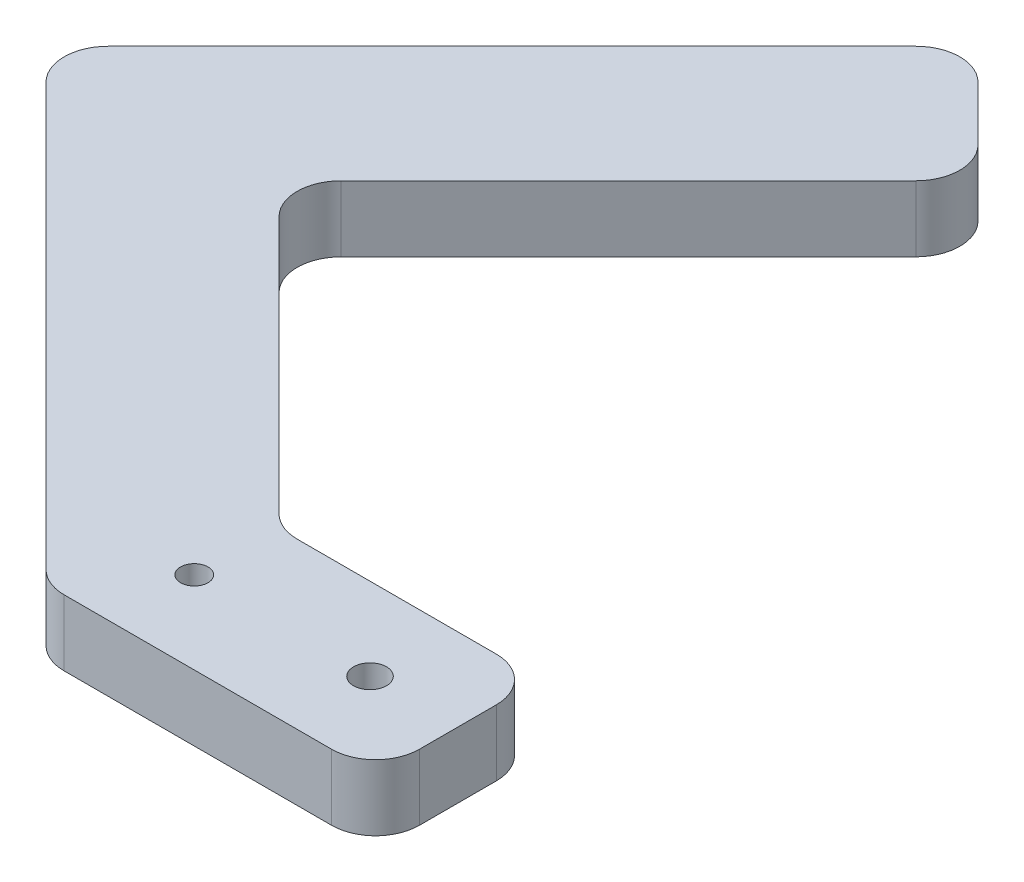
ISO-10303-21;
HEADER;
FILE_DESCRIPTION(('STEP AP214'),'2;1');
FILE_NAME('part.step','',(''),(''),'','','');
FILE_SCHEMA(('AUTOMOTIVE_DESIGN { 1 0 10303 214 1 1 1 1 }'));
ENDSEC;
DATA;
#1=APPLICATION_CONTEXT('core data for automotive mechanical design processes');
#2=APPLICATION_PROTOCOL_DEFINITION('international standard','automotive_design',2000,#1);
#3=PRODUCT_CONTEXT('',#1,'mechanical');
#4=PRODUCT('Part','Part','',(#3));
#5=PRODUCT_RELATED_PRODUCT_CATEGORY('part','',(#4));
#6=PRODUCT_DEFINITION_FORMATION('','',#4);
#7=PRODUCT_DEFINITION_CONTEXT('part definition',#1,'design');
#8=PRODUCT_DEFINITION('design','',#6,#7);
#9=PRODUCT_DEFINITION_SHAPE('','',#8);
#10=(LENGTH_UNIT() NAMED_UNIT(*) SI_UNIT(.MILLI.,.METRE.));
#11=(NAMED_UNIT(*) PLANE_ANGLE_UNIT() SI_UNIT($,.RADIAN.));
#12=(NAMED_UNIT(*) SI_UNIT($,.STERADIAN.) SOLID_ANGLE_UNIT());
#13=UNCERTAINTY_MEASURE_WITH_UNIT(LENGTH_MEASURE(1.E-05),#10,'distance_accuracy_value','');
#14=(GEOMETRIC_REPRESENTATION_CONTEXT(3) GLOBAL_UNCERTAINTY_ASSIGNED_CONTEXT((#13)) GLOBAL_UNIT_ASSIGNED_CONTEXT((#10,
#11,#12)) REPRESENTATION_CONTEXT('',''));
#15=CARTESIAN_POINT('',(0.,0.,0.));
#16=DIRECTION('',(0.,0.,1.));
#17=DIRECTION('',(1.,0.,0.));
#18=AXIS2_PLACEMENT_3D('',#15,#16,#17);
#19=CARTESIAN_POINT('',(0.,6.,0.));
#20=DIRECTION('',(0.,1.,0.));
#21=DIRECTION('',(0.,0.,1.));
#22=AXIS2_PLACEMENT_3D('',#19,#20,#21);
#23=PLANE('',#22);
#24=CARTESIAN_POINT('',(-8.,6.,-7.5));
#25=DIRECTION('',(0.,1.,0.));
#26=DIRECTION('',(0.,0.,1.));
#27=AXIS2_PLACEMENT_3D('',#24,#25,#26);
#28=CIRCLE('',#27,1.5);
#29=CARTESIAN_POINT('',(-8.,6.,-6.));
#30=VERTEX_POINT('',#29);
#31=EDGE_CURVE('E338',#30,#30,#28,.T.);
#32=ORIENTED_EDGE('',*,*,#31,.F.);
#33=EDGE_LOOP('',(#32));
#34=FACE_BOUND('',#33,.T.);
#35=DIRECTION('',(0.,0.,-1.));
#36=VECTOR('',#35,1.);
#37=CARTESIAN_POINT('',(0.,6.,0.));
#38=LINE('',#37,#36);
#39=CARTESIAN_POINT('',(0.,6.,-4.));
#40=VERTEX_POINT('',#39);
#41=CARTESIAN_POINT('',(0.,6.,-11.));
#42=VERTEX_POINT('',#41);
#43=EDGE_CURVE('E322',#40,#42,#38,.T.);
#44=ORIENTED_EDGE('',*,*,#43,.T.);
#45=CARTESIAN_POINT('',(-4.,6.,-11.));
#46=DIRECTION('',(0.,1.,0.));
#47=DIRECTION('',(0.,0.,1.));
#48=AXIS2_PLACEMENT_3D('',#45,#46,#47);
#49=CIRCLE('',#48,4.);
#50=CARTESIAN_POINT('',(-4.,6.,-15.));
#51=VERTEX_POINT('',#50);
#52=EDGE_CURVE('E264',#42,#51,#49,.T.);
#53=ORIENTED_EDGE('',*,*,#52,.T.);
#54=DIRECTION('',(-1.,0.,0.));
#55=VECTOR('',#54,1.);
#56=CARTESIAN_POINT('',(0.,6.,-15.));
#57=LINE('',#56,#55);
#58=CARTESIAN_POINT('',(-22.1299423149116,6.,-15.));
#59=VERTEX_POINT('',#58);
#60=EDGE_CURVE('E313',#51,#59,#57,.T.);
#61=ORIENTED_EDGE('',*,*,#60,.T.);
#62=CARTESIAN_POINT('',(-22.1299423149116,6.,-19.));
#63=DIRECTION('',(0.,1.,0.));
#64=DIRECTION('',(0.,0.,1.));
#65=AXIS2_PLACEMENT_3D('',#62,#63,#64);
#66=CIRCLE('',#65,4.);
#67=CARTESIAN_POINT('',(-24.9583694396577,6.,-16.1715728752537));
#68=VERTEX_POINT('',#67);
#69=EDGE_CURVE('E11',#59,#68,#66,.F.);
#70=ORIENTED_EDGE('',*,*,#69,.T.);
#71=DIRECTION('',(-0.707106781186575,0.,-0.707106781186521));
#72=VECTOR('',#71,1.);
#73=CARTESIAN_POINT('',(-23.7867965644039,6.,-15.));
#74=LINE('',#73,#72);
#75=CARTESIAN_POINT('',(-48.3847763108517,6.,-39.5979797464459));
#76=VERTEX_POINT('',#75);
#77=EDGE_CURVE('E312',#68,#76,#74,.T.);
#78=ORIENTED_EDGE('',*,*,#77,.T.);
#79=CARTESIAN_POINT('',(-45.5563491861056,6.,-42.4264068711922));
#80=DIRECTION('',(0.,1.,0.));
#81=DIRECTION('',(0.,0.,1.));
#82=AXIS2_PLACEMENT_3D('',#79,#80,#81);
#83=CIRCLE('',#82,4.);
#84=CARTESIAN_POINT('',(-48.3847763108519,6.,-45.2548339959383));
#85=VERTEX_POINT('',#84);
#86=EDGE_CURVE('E171',#76,#85,#83,.F.);
#87=ORIENTED_EDGE('',*,*,#86,.T.);
#88=DIRECTION('',(0.707106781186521,0.,-0.707106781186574));
#89=VECTOR('',#88,1.);
#90=CARTESIAN_POINT('',(-51.213203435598,6.,-42.426406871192));
#91=LINE('',#90,#89);
#92=CARTESIAN_POINT('',(-22.2218254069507,6.,-71.4177848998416));
#93=VERTEX_POINT('',#92);
#94=EDGE_CURVE('E181',#85,#93,#91,.T.);
#95=ORIENTED_EDGE('',*,*,#94,.T.);
#96=CARTESIAN_POINT('',(-25.050252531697,6.,-74.2462120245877));
#97=DIRECTION('',(0.,1.,0.));
#98=DIRECTION('',(0.,0.,1.));
#99=AXIS2_PLACEMENT_3D('',#96,#97,#98);
#100=CIRCLE('',#99,4.);
#101=CARTESIAN_POINT('',(-22.2218254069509,6.,-77.074639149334));
#102=VERTEX_POINT('',#101);
#103=EDGE_CURVE('E253',#93,#102,#100,.T.);
#104=ORIENTED_EDGE('',*,*,#103,.T.);
#105=DIRECTION('',(-0.707106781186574,0.,-0.707106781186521));
#106=VECTOR('',#105,1.);
#107=CARTESIAN_POINT('',(-19.3933982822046,6.,-74.2462120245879));
#108=LINE('',#107,#106);
#109=CARTESIAN_POINT('',(-27.1715728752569,6.,-82.0243866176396));
#110=VERTEX_POINT('',#109);
#111=EDGE_CURVE('E320',#102,#110,#108,.T.);
#112=ORIENTED_EDGE('',*,*,#111,.T.);
#113=CARTESIAN_POINT('',(-30.000000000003,6.,-79.1959594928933));
#114=DIRECTION('',(0.,1.,0.));
#115=DIRECTION('',(0.,0.,1.));
#116=AXIS2_PLACEMENT_3D('',#113,#114,#115);
#117=CIRCLE('',#116,4.);
#118=CARTESIAN_POINT('',(-32.8284271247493,6.,-82.0243866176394));
#119=VERTEX_POINT('',#118);
#120=EDGE_CURVE('E250',#110,#119,#117,.T.);
#121=ORIENTED_EDGE('',*,*,#120,.T.);
#122=DIRECTION('',(-0.707106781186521,0.,0.707106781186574));
#123=VECTOR('',#122,1.);
#124=CARTESIAN_POINT('',(-30.0000000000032,6.,-84.8528137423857));
#125=LINE('',#124,#123);
#126=CARTESIAN_POINT('',(-69.5979797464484,6.,-45.2548339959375));
#127=VERTEX_POINT('',#126);
#128=EDGE_CURVE('E329',#119,#127,#125,.T.);
#129=ORIENTED_EDGE('',*,*,#128,.T.);
#130=CARTESIAN_POINT('',(-66.7695526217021,6.,-42.4264068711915));
#131=DIRECTION('',(0.,1.,0.));
#132=DIRECTION('',(0.,0.,1.));
#133=AXIS2_PLACEMENT_3D('',#130,#131,#132);
#134=CIRCLE('',#133,4.);
#135=CARTESIAN_POINT('',(-69.5979797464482,6.,-39.5979797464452));
#136=VERTEX_POINT('',#135);
#137=EDGE_CURVE('E68',#127,#136,#134,.T.);
#138=ORIENTED_EDGE('',*,*,#137,.T.);
#139=DIRECTION('',(0.707106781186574,0.,0.707106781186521));
#140=VECTOR('',#139,1.);
#141=CARTESIAN_POINT('',(-72.4264068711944,6.,-42.4264068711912));
#142=LINE('',#141,#140);
#143=CARTESIAN_POINT('',(-31.1715728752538,6.,-1.17157287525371));
#144=VERTEX_POINT('',#143);
#145=EDGE_CURVE('E212',#136,#144,#142,.T.);
#146=ORIENTED_EDGE('',*,*,#145,.T.);
#147=CARTESIAN_POINT('',(-28.3431457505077,6.,-4.));
#148=DIRECTION('',(0.,1.,0.));
#149=DIRECTION('',(0.,0.,1.));
#150=AXIS2_PLACEMENT_3D('',#147,#148,#149);
#151=CIRCLE('',#150,4.);
#152=CARTESIAN_POINT('',(-28.3431457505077,6.,0.));
#153=VERTEX_POINT('',#152);
#154=EDGE_CURVE('E258',#144,#153,#151,.T.);
#155=ORIENTED_EDGE('',*,*,#154,.T.);
#156=DIRECTION('',(1.,0.,0.));
#157=VECTOR('',#156,1.);
#158=CARTESIAN_POINT('',(-30.,6.,0.));
#159=LINE('',#158,#157);
#160=CARTESIAN_POINT('',(-4.,6.,0.));
#161=VERTEX_POINT('',#160);
#162=EDGE_CURVE('E210',#153,#161,#159,.T.);
#163=ORIENTED_EDGE('',*,*,#162,.T.);
#164=CARTESIAN_POINT('',(-4.,6.,-4.));
#165=DIRECTION('',(0.,1.,0.));
#166=DIRECTION('',(0.,0.,1.));
#167=AXIS2_PLACEMENT_3D('',#164,#165,#166);
#168=CIRCLE('',#167,4.);
#169=EDGE_CURVE('E261',#161,#40,#168,.T.);
#170=ORIENTED_EDGE('',*,*,#169,.T.);
#171=EDGE_LOOP('',(#44,#53,#61,#70,#78,#87,#95,#104,#112,#121,#129,#138,#146,#155,#163,#170));
#172=FACE_BOUND('',#171,.T.);
#173=CARTESIAN_POINT('',(-24.,6.,-7.5));
#174=DIRECTION('',(0.,1.,0.));
#175=DIRECTION('',(0.,0.,1.));
#176=AXIS2_PLACEMENT_3D('',#173,#174,#175);
#177=CIRCLE('',#176,1.25);
#178=CARTESIAN_POINT('',(-24.,6.,-6.25));
#179=VERTEX_POINT('',#178);
#180=EDGE_CURVE('E360',#179,#179,#177,.T.);
#181=ORIENTED_EDGE('',*,*,#180,.F.);
#182=EDGE_LOOP('',(#181));
#183=FACE_BOUND('',#182,.T.);
#184=ADVANCED_FACE('F45',(#34,#172,#183),#23,.T.);
#185=CARTESIAN_POINT('',(0.,0.,0.));
#186=DIRECTION('',(0.,1.,0.));
#187=DIRECTION('',(0.,0.,1.));
#188=AXIS2_PLACEMENT_3D('',#185,#186,#187);
#189=PLANE('',#188);
#190=DIRECTION('',(-1.,0.,0.));
#191=VECTOR('',#190,1.);
#192=CARTESIAN_POINT('',(0.,0.,-15.));
#193=LINE('',#192,#191);
#194=CARTESIAN_POINT('',(-4.,0.,-15.));
#195=VERTEX_POINT('',#194);
#196=CARTESIAN_POINT('',(-22.1299423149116,0.,-15.));
#197=VERTEX_POINT('',#196);
#198=EDGE_CURVE('E200',#195,#197,#193,.T.);
#199=ORIENTED_EDGE('',*,*,#198,.F.);
#200=CARTESIAN_POINT('',(-4.,0.,-11.));
#201=DIRECTION('',(0.,1.,0.));
#202=DIRECTION('',(0.,0.,1.));
#203=AXIS2_PLACEMENT_3D('',#200,#201,#202);
#204=CIRCLE('',#203,4.);
#205=CARTESIAN_POINT('',(0.,0.,-11.));
#206=VERTEX_POINT('',#205);
#207=EDGE_CURVE('E240',#195,#206,#204,.F.);
#208=ORIENTED_EDGE('',*,*,#207,.T.);
#209=DIRECTION('',(0.,0.,-1.));
#210=VECTOR('',#209,1.);
#211=CARTESIAN_POINT('',(0.,0.,0.));
#212=LINE('',#211,#210);
#213=CARTESIAN_POINT('',(0.,0.,-4.));
#214=VERTEX_POINT('',#213);
#215=EDGE_CURVE('E305',#214,#206,#212,.T.);
#216=ORIENTED_EDGE('',*,*,#215,.F.);
#217=CARTESIAN_POINT('',(-4.,0.,-4.));
#218=DIRECTION('',(0.,1.,0.));
#219=DIRECTION('',(0.,0.,1.));
#220=AXIS2_PLACEMENT_3D('',#217,#218,#219);
#221=CIRCLE('',#220,4.);
#222=CARTESIAN_POINT('',(-4.,0.,0.));
#223=VERTEX_POINT('',#222);
#224=EDGE_CURVE('E237',#214,#223,#221,.F.);
#225=ORIENTED_EDGE('',*,*,#224,.T.);
#226=DIRECTION('',(1.,0.,0.));
#227=VECTOR('',#226,1.);
#228=CARTESIAN_POINT('',(-30.,0.,0.));
#229=LINE('',#228,#227);
#230=CARTESIAN_POINT('',(-28.3431457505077,0.,0.));
#231=VERTEX_POINT('',#230);
#232=EDGE_CURVE('E334',#231,#223,#229,.T.);
#233=ORIENTED_EDGE('',*,*,#232,.F.);
#234=CARTESIAN_POINT('',(-28.3431457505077,0.,-4.));
#235=DIRECTION('',(0.,1.,0.));
#236=DIRECTION('',(0.,0.,1.));
#237=AXIS2_PLACEMENT_3D('',#234,#235,#236);
#238=CIRCLE('',#237,4.);
#239=CARTESIAN_POINT('',(-31.1715728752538,0.,-1.17157287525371));
#240=VERTEX_POINT('',#239);
#241=EDGE_CURVE('E234',#231,#240,#238,.F.);
#242=ORIENTED_EDGE('',*,*,#241,.T.);
#243=DIRECTION('',(0.707106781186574,0.,0.707106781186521));
#244=VECTOR('',#243,1.);
#245=CARTESIAN_POINT('',(-72.4264068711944,0.,-42.4264068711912));
#246=LINE('',#245,#244);
#247=CARTESIAN_POINT('',(-69.5979797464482,0.,-39.5979797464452));
#248=VERTEX_POINT('',#247);
#249=EDGE_CURVE('E207',#248,#240,#246,.T.);
#250=ORIENTED_EDGE('',*,*,#249,.F.);
#251=CARTESIAN_POINT('',(-66.7695526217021,0.,-42.4264068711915));
#252=DIRECTION('',(0.,1.,0.));
#253=DIRECTION('',(0.,0.,1.));
#254=AXIS2_PLACEMENT_3D('',#251,#252,#253);
#255=CIRCLE('',#254,4.);
#256=CARTESIAN_POINT('',(-69.5979797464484,0.,-45.2548339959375));
#257=VERTEX_POINT('',#256);
#258=EDGE_CURVE('E231',#248,#257,#255,.F.);
#259=ORIENTED_EDGE('',*,*,#258,.T.);
#260=DIRECTION('',(-0.707106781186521,0.,0.707106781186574));
#261=VECTOR('',#260,1.);
#262=CARTESIAN_POINT('',(-30.0000000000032,0.,-84.8528137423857));
#263=LINE('',#262,#261);
#264=CARTESIAN_POINT('',(-32.8284271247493,0.,-82.0243866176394));
#265=VERTEX_POINT('',#264);
#266=EDGE_CURVE('E198',#265,#257,#263,.T.);
#267=ORIENTED_EDGE('',*,*,#266,.F.);
#268=CARTESIAN_POINT('',(-30.000000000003,0.,-79.1959594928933));
#269=DIRECTION('',(0.,1.,0.));
#270=DIRECTION('',(0.,0.,1.));
#271=AXIS2_PLACEMENT_3D('',#268,#269,#270);
#272=CIRCLE('',#271,4.);
#273=CARTESIAN_POINT('',(-27.1715728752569,0.,-82.0243866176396));
#274=VERTEX_POINT('',#273);
#275=EDGE_CURVE('E226',#265,#274,#272,.F.);
#276=ORIENTED_EDGE('',*,*,#275,.T.);
#277=DIRECTION('',(-0.707106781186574,0.,-0.707106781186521));
#278=VECTOR('',#277,1.);
#279=CARTESIAN_POINT('',(-19.3933982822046,0.,-74.2462120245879));
#280=LINE('',#279,#278);
#281=CARTESIAN_POINT('',(-22.2218254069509,0.,-77.074639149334));
#282=VERTEX_POINT('',#281);
#283=EDGE_CURVE('E192',#282,#274,#280,.T.);
#284=ORIENTED_EDGE('',*,*,#283,.F.);
#285=CARTESIAN_POINT('',(-25.050252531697,0.,-74.2462120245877));
#286=DIRECTION('',(0.,1.,0.));
#287=DIRECTION('',(0.,0.,1.));
#288=AXIS2_PLACEMENT_3D('',#285,#286,#287);
#289=CIRCLE('',#288,4.);
#290=CARTESIAN_POINT('',(-22.2218254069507,0.,-71.4177848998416));
#291=VERTEX_POINT('',#290);
#292=EDGE_CURVE('E190',#282,#291,#289,.F.);
#293=ORIENTED_EDGE('',*,*,#292,.T.);
#294=DIRECTION('',(0.707106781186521,0.,-0.707106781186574));
#295=VECTOR('',#294,1.);
#296=CARTESIAN_POINT('',(-51.213203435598,0.,-42.426406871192));
#297=LINE('',#296,#295);
#298=CARTESIAN_POINT('',(-48.3847763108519,0.,-45.2548339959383));
#299=VERTEX_POINT('',#298);
#300=EDGE_CURVE('E178',#299,#291,#297,.T.);
#301=ORIENTED_EDGE('',*,*,#300,.F.);
#302=CARTESIAN_POINT('',(-45.5563491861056,0.,-42.4264068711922));
#303=DIRECTION('',(0.,1.,0.));
#304=DIRECTION('',(0.,0.,1.));
#305=AXIS2_PLACEMENT_3D('',#302,#303,#304);
#306=CIRCLE('',#305,4.);
#307=CARTESIAN_POINT('',(-48.3847763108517,0.,-39.5979797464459));
#308=VERTEX_POINT('',#307);
#309=EDGE_CURVE('E160',#299,#308,#306,.T.);
#310=ORIENTED_EDGE('',*,*,#309,.T.);
#311=DIRECTION('',(-0.707106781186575,0.,-0.707106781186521));
#312=VECTOR('',#311,1.);
#313=CARTESIAN_POINT('',(-23.7867965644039,0.,-15.));
#314=LINE('',#313,#312);
#315=CARTESIAN_POINT('',(-24.9583694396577,0.,-16.1715728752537));
#316=VERTEX_POINT('',#315);
#317=EDGE_CURVE('E193',#316,#308,#314,.T.);
#318=ORIENTED_EDGE('',*,*,#317,.F.);
#319=CARTESIAN_POINT('',(-22.1299423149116,0.,-19.));
#320=DIRECTION('',(0.,1.,0.));
#321=DIRECTION('',(0.,0.,1.));
#322=AXIS2_PLACEMENT_3D('',#319,#320,#321);
#323=CIRCLE('',#322,4.);
#324=EDGE_CURVE('E54',#316,#197,#323,.T.);
#325=ORIENTED_EDGE('',*,*,#324,.T.);
#326=EDGE_LOOP('',(#199,#208,#216,#225,#233,#242,#250,#259,#267,#276,#284,#293,#301,#310,#318,#325));
#327=FACE_BOUND('',#326,.T.);
#328=CARTESIAN_POINT('',(-8.,0.,-7.5));
#329=DIRECTION('',(0.,1.,0.));
#330=DIRECTION('',(0.,0.,1.));
#331=AXIS2_PLACEMENT_3D('',#328,#329,#330);
#332=CIRCLE('',#331,1.5);
#333=CARTESIAN_POINT('',(-8.,0.,-6.));
#334=VERTEX_POINT('',#333);
#335=EDGE_CURVE('E356',#334,#334,#332,.T.);
#336=ORIENTED_EDGE('',*,*,#335,.T.);
#337=EDGE_LOOP('',(#336));
#338=FACE_BOUND('',#337,.T.);
#339=CARTESIAN_POINT('',(-24.,0.,-7.5));
#340=DIRECTION('',(0.,1.,0.));
#341=DIRECTION('',(0.,0.,1.));
#342=AXIS2_PLACEMENT_3D('',#339,#340,#341);
#343=CIRCLE('',#342,1.25);
#344=CARTESIAN_POINT('',(-24.,0.,-6.25));
#345=VERTEX_POINT('',#344);
#346=EDGE_CURVE('E364',#345,#345,#343,.T.);
#347=ORIENTED_EDGE('',*,*,#346,.T.);
#348=EDGE_LOOP('',(#347));
#349=FACE_BOUND('',#348,.T.);
#350=ADVANCED_FACE('F187',(#327,#338,#349),#189,.F.);
#351=CARTESIAN_POINT('',(-30.,6.,0.));
#352=DIRECTION('',(0.,0.,-1.));
#353=DIRECTION('',(-1.,0.,0.));
#354=AXIS2_PLACEMENT_3D('',#351,#352,#353);
#355=PLANE('',#354);
#356=ORIENTED_EDGE('',*,*,#232,.T.);
#357=DIRECTION('',(0.,-1.,0.));
#358=VECTOR('',#357,1.);
#359=CARTESIAN_POINT('',(-4.,6.,0.));
#360=LINE('',#359,#358);
#361=EDGE_CURVE('E271',#223,#161,#360,.F.);
#362=ORIENTED_EDGE('',*,*,#361,.T.);
#363=ORIENTED_EDGE('',*,*,#162,.F.);
#364=DIRECTION('',(0.,-1.,0.));
#365=VECTOR('',#364,1.);
#366=CARTESIAN_POINT('',(-28.3431457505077,6.,0.));
#367=LINE('',#366,#365);
#368=EDGE_CURVE('E267',#153,#231,#367,.T.);
#369=ORIENTED_EDGE('',*,*,#368,.T.);
#370=EDGE_LOOP('',(#356,#362,#363,#369));
#371=FACE_BOUND('',#370,.T.);
#372=ADVANCED_FACE('F381',(#371),#355,.F.);
#373=CARTESIAN_POINT('',(0.,6.,0.));
#374=DIRECTION('',(-1.,0.,0.));
#375=DIRECTION('',(0.,0.,1.));
#376=AXIS2_PLACEMENT_3D('',#373,#374,#375);
#377=PLANE('',#376);
#378=ORIENTED_EDGE('',*,*,#215,.T.);
#379=DIRECTION('',(0.,-1.,0.));
#380=VECTOR('',#379,1.);
#381=CARTESIAN_POINT('',(0.,6.,-11.));
#382=LINE('',#381,#380);
#383=EDGE_CURVE('E247',#206,#42,#382,.F.);
#384=ORIENTED_EDGE('',*,*,#383,.T.);
#385=ORIENTED_EDGE('',*,*,#43,.F.);
#386=DIRECTION('',(0.,-1.,0.));
#387=VECTOR('',#386,1.);
#388=CARTESIAN_POINT('',(0.,6.,-4.));
#389=LINE('',#388,#387);
#390=EDGE_CURVE('E243',#40,#214,#389,.T.);
#391=ORIENTED_EDGE('',*,*,#390,.T.);
#392=EDGE_LOOP('',(#378,#384,#385,#391));
#393=FACE_BOUND('',#392,.T.);
#394=ADVANCED_FACE('F344',(#393),#377,.F.);
#395=CARTESIAN_POINT('',(0.,6.,-15.));
#396=DIRECTION('',(0.,0.,1.));
#397=DIRECTION('',(1.,0.,0.));
#398=AXIS2_PLACEMENT_3D('',#395,#396,#397);
#399=PLANE('',#398);
#400=ORIENTED_EDGE('',*,*,#198,.T.);
#401=DIRECTION('',(0.,-1.,0.));
#402=VECTOR('',#401,1.);
#403=CARTESIAN_POINT('',(-22.1299423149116,6.,-15.));
#404=LINE('',#403,#402);
#405=EDGE_CURVE('E223',#197,#59,#404,.F.);
#406=ORIENTED_EDGE('',*,*,#405,.T.);
#407=ORIENTED_EDGE('',*,*,#60,.F.);
#408=DIRECTION('',(0.,-1.,0.));
#409=VECTOR('',#408,1.);
#410=CARTESIAN_POINT('',(-4.,6.,-15.));
#411=LINE('',#410,#409);
#412=EDGE_CURVE('E219',#51,#195,#411,.T.);
#413=ORIENTED_EDGE('',*,*,#412,.T.);
#414=EDGE_LOOP('',(#400,#406,#407,#413));
#415=FACE_BOUND('',#414,.T.);
#416=ADVANCED_FACE('F300',(#415),#399,.F.);
#417=CARTESIAN_POINT('',(-23.7867965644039,6.,-15.));
#418=DIRECTION('',(-0.707106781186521,0.,0.707106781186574));
#419=DIRECTION('',(0.707106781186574,0.,0.707106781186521));
#420=AXIS2_PLACEMENT_3D('',#417,#418,#419);
#421=PLANE('',#420);
#422=ORIENTED_EDGE('',*,*,#317,.T.);
#423=DIRECTION('',(0.,-1.,0.));
#424=VECTOR('',#423,1.);
#425=CARTESIAN_POINT('',(-48.3847763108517,6.,-39.5979797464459));
#426=LINE('',#425,#424);
#427=EDGE_CURVE('E165',#308,#76,#426,.F.);
#428=ORIENTED_EDGE('',*,*,#427,.T.);
#429=ORIENTED_EDGE('',*,*,#77,.F.);
#430=DIRECTION('',(0.,-1.,0.));
#431=VECTOR('',#430,1.);
#432=CARTESIAN_POINT('',(-24.9583694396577,0.,-16.1715728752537));
#433=LINE('',#432,#431);
#434=EDGE_CURVE('E183',#68,#316,#433,.T.);
#435=ORIENTED_EDGE('',*,*,#434,.T.);
#436=EDGE_LOOP('',(#422,#428,#429,#435));
#437=FACE_BOUND('',#436,.T.);
#438=ADVANCED_FACE('F315',(#437),#421,.F.);
#439=CARTESIAN_POINT('',(-51.213203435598,6.,-42.426406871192));
#440=DIRECTION('',(-0.707106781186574,0.,-0.707106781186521));
#441=DIRECTION('',(-0.707106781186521,0.,0.707106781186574));
#442=AXIS2_PLACEMENT_3D('',#439,#440,#441);
#443=PLANE('',#442);
#444=ORIENTED_EDGE('',*,*,#94,.F.);
#445=DIRECTION('',(0.,-1.,0.));
#446=VECTOR('',#445,1.);
#447=CARTESIAN_POINT('',(-48.3847763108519,0.,-45.2548339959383));
#448=LINE('',#447,#446);
#449=EDGE_CURVE('E164',#85,#299,#448,.T.);
#450=ORIENTED_EDGE('',*,*,#449,.T.);
#451=ORIENTED_EDGE('',*,*,#300,.T.);
#452=DIRECTION('',(0.,-1.,0.));
#453=VECTOR('',#452,1.);
#454=CARTESIAN_POINT('',(-22.2218254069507,6.,-71.4177848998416));
#455=LINE('',#454,#453);
#456=EDGE_CURVE('E184',#291,#93,#455,.F.);
#457=ORIENTED_EDGE('',*,*,#456,.T.);
#458=EDGE_LOOP('',(#444,#450,#451,#457));
#459=FACE_BOUND('',#458,.T.);
#460=ADVANCED_FACE('F177',(#459),#443,.F.);
#461=CARTESIAN_POINT('',(-19.3933982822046,6.,-74.2462120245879));
#462=DIRECTION('',(-0.707106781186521,0.,0.707106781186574));
#463=DIRECTION('',(0.707106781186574,0.,0.707106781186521));
#464=AXIS2_PLACEMENT_3D('',#461,#462,#463);
#465=PLANE('',#464);
#466=ORIENTED_EDGE('',*,*,#111,.F.);
#467=DIRECTION('',(0.,-1.,0.));
#468=VECTOR('',#467,1.);
#469=CARTESIAN_POINT('',(-22.2218254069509,6.,-77.074639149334));
#470=LINE('',#469,#468);
#471=EDGE_CURVE('E172',#102,#282,#470,.T.);
#472=ORIENTED_EDGE('',*,*,#471,.T.);
#473=ORIENTED_EDGE('',*,*,#283,.T.);
#474=DIRECTION('',(0.,-1.,0.));
#475=VECTOR('',#474,1.);
#476=CARTESIAN_POINT('',(-27.1715728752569,6.,-82.0243866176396));
#477=LINE('',#476,#475);
#478=EDGE_CURVE('E287',#274,#110,#477,.F.);
#479=ORIENTED_EDGE('',*,*,#478,.T.);
#480=EDGE_LOOP('',(#466,#472,#473,#479));
#481=FACE_BOUND('',#480,.T.);
#482=ADVANCED_FACE('F394',(#481),#465,.F.);
#483=CARTESIAN_POINT('',(-30.0000000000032,6.,-84.8528137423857));
#484=DIRECTION('',(0.707106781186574,0.,0.707106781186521));
#485=DIRECTION('',(0.707106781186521,0.,-0.707106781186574));
#486=AXIS2_PLACEMENT_3D('',#483,#484,#485);
#487=PLANE('',#486);
#488=ORIENTED_EDGE('',*,*,#266,.T.);
#489=DIRECTION('',(0.,-1.,0.));
#490=VECTOR('',#489,1.);
#491=CARTESIAN_POINT('',(-69.5979797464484,6.,-45.2548339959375));
#492=LINE('',#491,#490);
#493=EDGE_CURVE('E284',#257,#127,#492,.F.);
#494=ORIENTED_EDGE('',*,*,#493,.T.);
#495=ORIENTED_EDGE('',*,*,#128,.F.);
#496=DIRECTION('',(0.,-1.,0.));
#497=VECTOR('',#496,1.);
#498=CARTESIAN_POINT('',(-32.8284271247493,6.,-82.0243866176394));
#499=LINE('',#498,#497);
#500=EDGE_CURVE('E280',#119,#265,#499,.T.);
#501=ORIENTED_EDGE('',*,*,#500,.T.);
#502=EDGE_LOOP('',(#488,#494,#495,#501));
#503=FACE_BOUND('',#502,.T.);
#504=ADVANCED_FACE('F391',(#503),#487,.F.);
#505=CARTESIAN_POINT('',(-72.4264068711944,6.,-42.4264068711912));
#506=DIRECTION('',(0.707106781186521,0.,-0.707106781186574));
#507=DIRECTION('',(-0.707106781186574,0.,-0.707106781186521));
#508=AXIS2_PLACEMENT_3D('',#505,#506,#507);
#509=PLANE('',#508);
#510=ORIENTED_EDGE('',*,*,#249,.T.);
#511=DIRECTION('',(0.,-1.,0.));
#512=VECTOR('',#511,1.);
#513=CARTESIAN_POINT('',(-31.1715728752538,6.,-1.1715728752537));
#514=LINE('',#513,#512);
#515=EDGE_CURVE('E61',#240,#144,#514,.F.);
#516=ORIENTED_EDGE('',*,*,#515,.T.);
#517=ORIENTED_EDGE('',*,*,#145,.F.);
#518=DIRECTION('',(0.,-1.,0.));
#519=VECTOR('',#518,1.);
#520=CARTESIAN_POINT('',(-69.5979797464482,6.,-39.5979797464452));
#521=LINE('',#520,#519);
#522=EDGE_CURVE('E274',#136,#248,#521,.T.);
#523=ORIENTED_EDGE('',*,*,#522,.T.);
#524=EDGE_LOOP('',(#510,#516,#517,#523));
#525=FACE_BOUND('',#524,.T.);
#526=ADVANCED_FACE('F388',(#525),#509,.F.);
#527=CARTESIAN_POINT('',(-8.,6.,-7.5));
#528=DIRECTION('',(0.,-1.,0.));
#529=DIRECTION('',(0.,0.,-1.));
#530=AXIS2_PLACEMENT_3D('',#527,#528,#529);
#531=CYLINDRICAL_SURFACE('',#530,1.5);
#532=ORIENTED_EDGE('',*,*,#31,.T.);
#533=EDGE_LOOP('',(#532));
#534=FACE_BOUND('',#533,.T.);
#535=ORIENTED_EDGE('',*,*,#335,.F.);
#536=EDGE_LOOP('',(#535));
#537=FACE_BOUND('',#536,.T.);
#538=ADVANCED_FACE('F385',(#534,#537),#531,.F.);
#539=CARTESIAN_POINT('',(-24.,6.,-7.5));
#540=DIRECTION('',(0.,-1.,0.));
#541=DIRECTION('',(0.,0.,-1.));
#542=AXIS2_PLACEMENT_3D('',#539,#540,#541);
#543=CYLINDRICAL_SURFACE('',#542,1.25);
#544=ORIENTED_EDGE('',*,*,#180,.T.);
#545=EDGE_LOOP('',(#544));
#546=FACE_BOUND('',#545,.T.);
#547=ORIENTED_EDGE('',*,*,#346,.F.);
#548=EDGE_LOOP('',(#547));
#549=FACE_BOUND('',#548,.T.);
#550=ADVANCED_FACE('F372',(#546,#549),#543,.F.);
#551=CARTESIAN_POINT('',(-45.5563491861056,6.,-42.4264068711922));
#552=DIRECTION('',(0.,1.,0.));
#553=DIRECTION('',(0.,0.,1.));
#554=AXIS2_PLACEMENT_3D('',#551,#552,#553);
#555=CYLINDRICAL_SURFACE('',#554,4.);
#556=ORIENTED_EDGE('',*,*,#86,.F.);
#557=ORIENTED_EDGE('',*,*,#427,.F.);
#558=ORIENTED_EDGE('',*,*,#309,.F.);
#559=ORIENTED_EDGE('',*,*,#449,.F.);
#560=EDGE_LOOP('',(#556,#557,#558,#559));
#561=FACE_BOUND('',#560,.T.);
#562=ADVANCED_FACE('F163',(#561),#555,.F.);
#563=CARTESIAN_POINT('',(-22.1299423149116,6.,-19.));
#564=DIRECTION('',(0.,1.,0.));
#565=DIRECTION('',(0.,0.,1.));
#566=AXIS2_PLACEMENT_3D('',#563,#564,#565);
#567=CYLINDRICAL_SURFACE('',#566,4.);
#568=ORIENTED_EDGE('',*,*,#69,.F.);
#569=ORIENTED_EDGE('',*,*,#405,.F.);
#570=ORIENTED_EDGE('',*,*,#324,.F.);
#571=ORIENTED_EDGE('',*,*,#434,.F.);
#572=EDGE_LOOP('',(#568,#569,#570,#571));
#573=FACE_BOUND('',#572,.T.);
#574=ADVANCED_FACE('F307',(#573),#567,.F.);
#575=CARTESIAN_POINT('',(-4.,6.,-11.));
#576=DIRECTION('',(0.,-1.,0.));
#577=DIRECTION('',(0.,0.,-1.));
#578=AXIS2_PLACEMENT_3D('',#575,#576,#577);
#579=CYLINDRICAL_SURFACE('',#578,4.);
#580=ORIENTED_EDGE('',*,*,#52,.F.);
#581=ORIENTED_EDGE('',*,*,#383,.F.);
#582=ORIENTED_EDGE('',*,*,#207,.F.);
#583=ORIENTED_EDGE('',*,*,#412,.F.);
#584=EDGE_LOOP('',(#580,#581,#582,#583));
#585=FACE_BOUND('',#584,.T.);
#586=ADVANCED_FACE('F349',(#585),#579,.T.);
#587=CARTESIAN_POINT('',(-4.,6.,-4.));
#588=DIRECTION('',(0.,-1.,0.));
#589=DIRECTION('',(0.,0.,-1.));
#590=AXIS2_PLACEMENT_3D('',#587,#588,#589);
#591=CYLINDRICAL_SURFACE('',#590,4.);
#592=ORIENTED_EDGE('',*,*,#169,.F.);
#593=ORIENTED_EDGE('',*,*,#361,.F.);
#594=ORIENTED_EDGE('',*,*,#224,.F.);
#595=ORIENTED_EDGE('',*,*,#390,.F.);
#596=EDGE_LOOP('',(#592,#593,#594,#595));
#597=FACE_BOUND('',#596,.T.);
#598=ADVANCED_FACE('F416',(#597),#591,.T.);
#599=CARTESIAN_POINT('',(-28.3431457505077,6.,-4.));
#600=DIRECTION('',(0.,-1.,0.));
#601=DIRECTION('',(0.,0.,-1.));
#602=AXIS2_PLACEMENT_3D('',#599,#600,#601);
#603=CYLINDRICAL_SURFACE('',#602,4.);
#604=ORIENTED_EDGE('',*,*,#154,.F.);
#605=ORIENTED_EDGE('',*,*,#515,.F.);
#606=ORIENTED_EDGE('',*,*,#241,.F.);
#607=ORIENTED_EDGE('',*,*,#368,.F.);
#608=EDGE_LOOP('',(#604,#605,#606,#607));
#609=FACE_BOUND('',#608,.T.);
#610=ADVANCED_FACE('F419',(#609),#603,.T.);
#611=CARTESIAN_POINT('',(-66.7695526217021,6.,-42.4264068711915));
#612=DIRECTION('',(0.,-1.,0.));
#613=DIRECTION('',(0.,0.,-1.));
#614=AXIS2_PLACEMENT_3D('',#611,#612,#613);
#615=CYLINDRICAL_SURFACE('',#614,4.);
#616=ORIENTED_EDGE('',*,*,#137,.F.);
#617=ORIENTED_EDGE('',*,*,#493,.F.);
#618=ORIENTED_EDGE('',*,*,#258,.F.);
#619=ORIENTED_EDGE('',*,*,#522,.F.);
#620=EDGE_LOOP('',(#616,#617,#618,#619));
#621=FACE_BOUND('',#620,.T.);
#622=ADVANCED_FACE('F423',(#621),#615,.T.);
#623=CARTESIAN_POINT('',(-25.050252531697,6.,-74.2462120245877));
#624=DIRECTION('',(0.,-1.,0.));
#625=DIRECTION('',(0.,0.,-1.));
#626=AXIS2_PLACEMENT_3D('',#623,#624,#625);
#627=CYLINDRICAL_SURFACE('',#626,4.);
#628=ORIENTED_EDGE('',*,*,#103,.F.);
#629=ORIENTED_EDGE('',*,*,#456,.F.);
#630=ORIENTED_EDGE('',*,*,#292,.F.);
#631=ORIENTED_EDGE('',*,*,#471,.F.);
#632=EDGE_LOOP('',(#628,#629,#630,#631));
#633=FACE_BOUND('',#632,.T.);
#634=ADVANCED_FACE('F426',(#633),#627,.T.);
#635=CARTESIAN_POINT('',(-30.000000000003,6.,-79.1959594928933));
#636=DIRECTION('',(0.,-1.,0.));
#637=DIRECTION('',(0.,0.,-1.));
#638=AXIS2_PLACEMENT_3D('',#635,#636,#637);
#639=CYLINDRICAL_SURFACE('',#638,4.);
#640=ORIENTED_EDGE('',*,*,#120,.F.);
#641=ORIENTED_EDGE('',*,*,#478,.F.);
#642=ORIENTED_EDGE('',*,*,#275,.F.);
#643=ORIENTED_EDGE('',*,*,#500,.F.);
#644=EDGE_LOOP('',(#640,#641,#642,#643));
#645=FACE_BOUND('',#644,.T.);
#646=ADVANCED_FACE('F47',(#645),#639,.T.);
#647=CLOSED_SHELL('',(#184,#350,#372,#394,#416,#438,#460,#482,#504,#526,#538,#550,#562,#574,
#586,#598,#610,#622,#634,#646));
#648=MANIFOLD_SOLID_BREP('B2',#647);
#649=ADVANCED_BREP_SHAPE_REPRESENTATION('',(#18,#648),#14);
#650=SHAPE_DEFINITION_REPRESENTATION(#9,#649);
ENDSEC;
END-ISO-10303-21;
